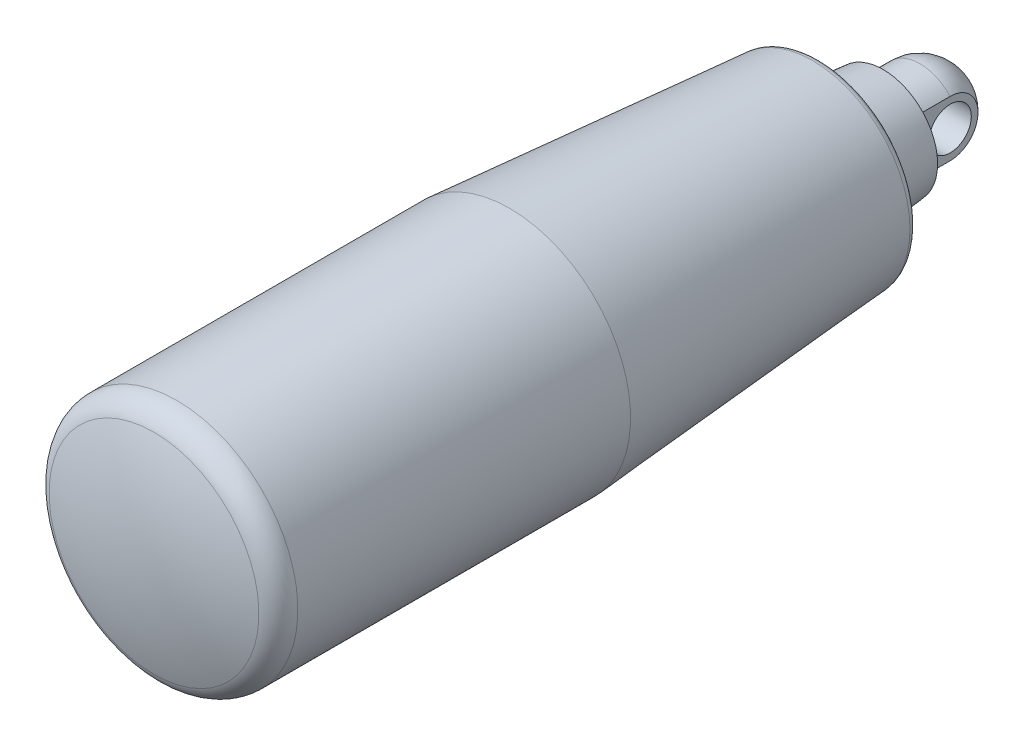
ISO-10303-21;
HEADER;
FILE_DESCRIPTION(('STEP AP214'),'2;1');
FILE_NAME('part.step','',(''),(''),'','','');
FILE_SCHEMA(('AUTOMOTIVE_DESIGN { 1 0 10303 214 1 1 1 1 }'));
ENDSEC;
DATA;
#1=APPLICATION_CONTEXT('core data for automotive mechanical design processes');
#2=APPLICATION_PROTOCOL_DEFINITION('international standard','automotive_design',2000,#1);
#3=PRODUCT_CONTEXT('',#1,'mechanical');
#4=PRODUCT('Part','Part','',(#3));
#5=PRODUCT_RELATED_PRODUCT_CATEGORY('part','',(#4));
#6=PRODUCT_DEFINITION_FORMATION('','',#4);
#7=PRODUCT_DEFINITION_CONTEXT('part definition',#1,'design');
#8=PRODUCT_DEFINITION('design','',#6,#7);
#9=PRODUCT_DEFINITION_SHAPE('','',#8);
#10=(LENGTH_UNIT() NAMED_UNIT(*) SI_UNIT(.MILLI.,.METRE.));
#11=(NAMED_UNIT(*) PLANE_ANGLE_UNIT() SI_UNIT($,.RADIAN.));
#12=(NAMED_UNIT(*) SI_UNIT($,.STERADIAN.) SOLID_ANGLE_UNIT());
#13=UNCERTAINTY_MEASURE_WITH_UNIT(LENGTH_MEASURE(1.E-05),#10,'distance_accuracy_value','');
#14=(GEOMETRIC_REPRESENTATION_CONTEXT(3) GLOBAL_UNCERTAINTY_ASSIGNED_CONTEXT((#13)) GLOBAL_UNIT_ASSIGNED_CONTEXT((#10,
#11,#12)) REPRESENTATION_CONTEXT('',''));
#15=CARTESIAN_POINT('',(0.,0.,0.));
#16=DIRECTION('',(0.,0.,1.));
#17=DIRECTION('',(1.,0.,0.));
#18=AXIS2_PLACEMENT_3D('',#15,#16,#17);
#19=CARTESIAN_POINT('',(20.,0.,0.));
#20=DIRECTION('',(1.,0.,0.));
#21=DIRECTION('',(0.,1.,0.));
#22=AXIS2_PLACEMENT_3D('',#19,#20,#21);
#23=CYLINDRICAL_SURFACE('',#22,2.);
#24=CARTESIAN_POINT('',(-2.875,0.,0.));
#25=DIRECTION('',(1.,0.,0.));
#26=DIRECTION('',(0.,1.,0.));
#27=AXIS2_PLACEMENT_3D('',#24,#25,#26);
#28=CIRCLE('',#27,2.);
#29=CARTESIAN_POINT('',(-2.875,2.,0.));
#30=VERTEX_POINT('',#29);
#31=EDGE_CURVE('E86',#30,#30,#28,.F.);
#32=ORIENTED_EDGE('',*,*,#31,.T.);
#33=EDGE_LOOP('',(#32));
#34=FACE_BOUND('',#33,.T.);
#35=CARTESIAN_POINT('',(2.875,0.,0.));
#36=DIRECTION('',(1.,0.,0.));
#37=DIRECTION('',(0.,1.,0.));
#38=AXIS2_PLACEMENT_3D('',#35,#36,#37);
#39=CIRCLE('',#38,2.);
#40=CARTESIAN_POINT('',(2.875,2.,0.));
#41=VERTEX_POINT('',#40);
#42=EDGE_CURVE('E19',#41,#41,#39,.F.);
#43=ORIENTED_EDGE('',*,*,#42,.F.);
#44=EDGE_LOOP('',(#43));
#45=FACE_BOUND('',#44,.T.);
#46=ADVANCED_FACE('F14',(#34,#45),#23,.F.);
#47=CARTESIAN_POINT('',(0.0100000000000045,0.,0.00999999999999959));
#48=DIRECTION('',(0.,-1.,0.));
#49=DIRECTION('',(1.,0.,0.));
#50=AXIS2_PLACEMENT_3D('',#47,#48,#49);
#51=CIRCLE('',#50,3.9);
#52=TRIMMED_CURVE('',#51,(PARAMETER_VALUE(-1.57336043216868)),
(PARAMETER_VALUE(1.57336043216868)),.T.,.PARAMETER.);
#53=CARTESIAN_POINT('',(0.,0.,0.00999999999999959));
#54=DIRECTION('',(0.,0.,1.));
#55=AXIS1_PLACEMENT('',#53,#54);
#56=SURFACE_OF_REVOLUTION('',#52,#55);
#57=CARTESIAN_POINT('',(0.,0.,-3.88998717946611));
#58=VERTEX_POINT('',#57);
#59=VERTEX_LOOP('',#58);
#60=FACE_BOUND('',#59,.T.);
#61=CARTESIAN_POINT('',(0.,0.,0.00999999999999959));
#62=DIRECTION('',(0.,0.,-1.));
#63=DIRECTION('',(0.,1.,0.));
#64=AXIS2_PLACEMENT_3D('',#61,#62,#63);
#65=CIRCLE('',#64,3.91);
#66=CARTESIAN_POINT('',(2.875,2.64999528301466,0.00999999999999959));
#67=VERTEX_POINT('',#66);
#68=CARTESIAN_POINT('',(-2.875,2.64999528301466,0.00999999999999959));
#69=VERTEX_POINT('',#68);
#70=EDGE_CURVE('E64',#67,#69,#65,.F.);
#71=ORIENTED_EDGE('',*,*,#70,.F.);
#72=CARTESIAN_POINT('',(2.875,-2.64999528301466,0.00999999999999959));
#73=CARTESIAN_POINT('',(2.875,-2.64999481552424,-0.064401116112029));
#74=CARTESIAN_POINT('',(2.875,-2.64685195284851,-0.138766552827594));
#75=CARTESIAN_POINT('',(2.875,-2.63431399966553,-0.28696469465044));
#76=CARTESIAN_POINT('',(2.875,-2.62491921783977,-0.360797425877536));
#77=CARTESIAN_POINT('',(2.875,-2.58744588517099,-0.580577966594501));
#78=CARTESIAN_POINT('',(2.875,-2.55007810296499,-0.72505216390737));
#79=CARTESIAN_POINT('',(2.875,-2.45161413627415,-1.00566603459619));
#80=CARTESIAN_POINT('',(2.875,-2.39050709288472,-1.14180186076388));
#81=CARTESIAN_POINT('',(2.875,-2.24631487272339,-1.40187676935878));
#82=CARTESIAN_POINT('',(2.875,-2.16323393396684,-1.52581819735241));
#83=CARTESIAN_POINT('',(2.875,-1.97744716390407,-1.75801135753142));
#84=CARTESIAN_POINT('',(2.875,-1.87473928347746,-1.86626144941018));
#85=CARTESIAN_POINT('',(2.875,-1.65260918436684,-2.06402226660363));
#86=CARTESIAN_POINT('',(2.875,-1.53318437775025,-2.15353008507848));
#87=CARTESIAN_POINT('',(2.875,-1.28089234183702,-2.31134889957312));
#88=CARTESIAN_POINT('',(2.875,-1.14801115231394,-2.37963757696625));
#89=CARTESIAN_POINT('',(2.875,-0.872691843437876,-2.49297406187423));
#90=CARTESIAN_POINT('',(2.875,-0.730254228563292,-2.53802309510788));
#91=CARTESIAN_POINT('',(2.875,-0.439606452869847,-2.60368573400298));
#92=CARTESIAN_POINT('',(2.875,-0.291387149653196,-2.62425887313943));
#93=CARTESIAN_POINT('',(2.875,0.00640670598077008,-2.64026272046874));
#94=CARTESIAN_POINT('',(2.875,0.155981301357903,-2.63569262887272));
#95=CARTESIAN_POINT('',(2.875,0.452420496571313,-2.60151491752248));
#96=CARTESIAN_POINT('',(2.875,0.599281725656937,-2.57187804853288));
#97=CARTESIAN_POINT('',(2.875,0.885938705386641,-2.48835511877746));
#98=CARTESIAN_POINT('',(2.875,1.02573450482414,-2.43446922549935));
#99=CARTESIAN_POINT('',(2.875,1.29420364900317,-2.30399710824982));
#100=CARTESIAN_POINT('',(2.875,1.42288307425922,-2.22742339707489));
#101=CARTESIAN_POINT('',(2.875,1.66552525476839,-2.05372889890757));
#102=CARTESIAN_POINT('',(2.875,1.77948884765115,-1.95660928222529));
#103=CARTESIAN_POINT('',(2.875,1.9892601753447,-1.74476571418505));
#104=CARTESIAN_POINT('',(2.875,2.08509966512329,-1.63007320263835));
#105=CARTESIAN_POINT('',(2.875,2.25616291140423,-1.38616312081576));
#106=CARTESIAN_POINT('',(2.875,2.33138023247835,-1.25694103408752));
#107=CARTESIAN_POINT('',(2.875,2.458958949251,-0.987812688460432));
#108=CARTESIAN_POINT('',(2.875,2.5113370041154,-0.847914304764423));
#109=CARTESIAN_POINT('',(2.875,2.59176333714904,-0.561415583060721));
#110=CARTESIAN_POINT('',(2.875,2.6198489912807,-0.414825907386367));
#111=CARTESIAN_POINT('',(2.875,2.6402872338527,-0.221052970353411));
#112=CARTESIAN_POINT('',(2.875,2.64392966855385,-0.174876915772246));
#113=CARTESIAN_POINT('',(2.875,2.64878036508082,-0.0824734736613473));
#114=CARTESIAN_POINT('',(2.875,2.64999263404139,-0.0362462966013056));
#115=CARTESIAN_POINT('',(2.875,2.64999528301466,0.00999999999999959));
#116=B_SPLINE_CURVE_WITH_KNOTS('',3,(#72,#73,#74,#75,#76,#77,#78,#79,#80,#81,#82,#83,#84,#85,
#86,#87,#88,#89,#90,#91,#92,#93,#94,#95,#96,#97,#98,#99,#100,#101,#102,#103,#104,#105,#106,#107,
#108,#109,#110,#111,#112,#113,#114,#115),.UNSPECIFIED.,.F.,.F.,(4,2,2,2,2,2,2,2,2,2,2,2,2,2,2,2,
2,2,2,2,2,4),(0.,0.22306612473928,0.446121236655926,0.891508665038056,1.33710006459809,
1.78260558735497,2.22815764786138,2.67377876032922,3.11986700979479,3.56593172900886,
4.01273291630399,4.45954831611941,4.90688580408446,5.35422020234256,5.80130834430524,
6.2483710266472,6.6946430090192,7.14105409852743,7.58713902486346,8.03253638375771,
8.17145040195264,8.31013517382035),.UNSPECIFIED.);
#117=CARTESIAN_POINT('',(2.875,-2.64999528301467,0.00999999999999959));
#118=VERTEX_POINT('',#117);
#119=EDGE_CURVE('E57',#118,#67,#116,.T.);
#120=ORIENTED_EDGE('',*,*,#119,.F.);
#121=CARTESIAN_POINT('',(0.,0.,0.00999999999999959));
#122=DIRECTION('',(0.,0.,-1.));
#123=DIRECTION('',(0.,1.,0.));
#124=AXIS2_PLACEMENT_3D('',#121,#122,#123);
#125=CIRCLE('',#124,3.91);
#126=CARTESIAN_POINT('',(-2.875,-2.64999528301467,0.00999999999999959));
#127=VERTEX_POINT('',#126);
#128=EDGE_CURVE('E89',#127,#118,#125,.F.);
#129=ORIENTED_EDGE('',*,*,#128,.F.);
#130=CARTESIAN_POINT('',(-2.875,-2.64999528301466,0.00999999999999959));
#131=CARTESIAN_POINT('',(-2.875,-2.64999481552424,-0.064401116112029));
#132=CARTESIAN_POINT('',(-2.875,-2.64685195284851,-0.138766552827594));
#133=CARTESIAN_POINT('',(-2.875,-2.63431399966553,-0.28696469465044));
#134=CARTESIAN_POINT('',(-2.875,-2.62491921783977,-0.360797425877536));
#135=CARTESIAN_POINT('',(-2.875,-2.58744588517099,-0.580577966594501));
#136=CARTESIAN_POINT('',(-2.875,-2.55007810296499,-0.72505216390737));
#137=CARTESIAN_POINT('',(-2.875,-2.45161413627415,-1.00566603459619));
#138=CARTESIAN_POINT('',(-2.875,-2.39050709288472,-1.14180186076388));
#139=CARTESIAN_POINT('',(-2.875,-2.24631487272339,-1.40187676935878));
#140=CARTESIAN_POINT('',(-2.875,-2.16323393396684,-1.52581819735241));
#141=CARTESIAN_POINT('',(-2.875,-1.97744716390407,-1.75801135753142));
#142=CARTESIAN_POINT('',(-2.875,-1.87473928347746,-1.86626144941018));
#143=CARTESIAN_POINT('',(-2.875,-1.65260918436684,-2.06402226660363));
#144=CARTESIAN_POINT('',(-2.875,-1.53318437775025,-2.15353008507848));
#145=CARTESIAN_POINT('',(-2.875,-1.28089234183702,-2.31134889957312));
#146=CARTESIAN_POINT('',(-2.875,-1.14801115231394,-2.37963757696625));
#147=CARTESIAN_POINT('',(-2.875,-0.872691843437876,-2.49297406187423));
#148=CARTESIAN_POINT('',(-2.875,-0.730254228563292,-2.53802309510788));
#149=CARTESIAN_POINT('',(-2.875,-0.439606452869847,-2.60368573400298));
#150=CARTESIAN_POINT('',(-2.875,-0.291387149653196,-2.62425887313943));
#151=CARTESIAN_POINT('',(-2.875,0.00640670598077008,-2.64026272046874));
#152=CARTESIAN_POINT('',(-2.875,0.155981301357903,-2.63569262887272));
#153=CARTESIAN_POINT('',(-2.875,0.452420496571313,-2.60151491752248));
#154=CARTESIAN_POINT('',(-2.875,0.599281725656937,-2.57187804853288));
#155=CARTESIAN_POINT('',(-2.875,0.885938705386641,-2.48835511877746));
#156=CARTESIAN_POINT('',(-2.875,1.02573450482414,-2.43446922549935));
#157=CARTESIAN_POINT('',(-2.875,1.29420364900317,-2.30399710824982));
#158=CARTESIAN_POINT('',(-2.875,1.42288307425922,-2.22742339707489));
#159=CARTESIAN_POINT('',(-2.875,1.66552525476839,-2.05372889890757));
#160=CARTESIAN_POINT('',(-2.875,1.77948884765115,-1.95660928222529));
#161=CARTESIAN_POINT('',(-2.875,1.9892601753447,-1.74476571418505));
#162=CARTESIAN_POINT('',(-2.875,2.08509966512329,-1.63007320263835));
#163=CARTESIAN_POINT('',(-2.875,2.25616291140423,-1.38616312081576));
#164=CARTESIAN_POINT('',(-2.875,2.33138023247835,-1.25694103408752));
#165=CARTESIAN_POINT('',(-2.875,2.458958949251,-0.987812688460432));
#166=CARTESIAN_POINT('',(-2.875,2.5113370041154,-0.847914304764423));
#167=CARTESIAN_POINT('',(-2.875,2.59176333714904,-0.561415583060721));
#168=CARTESIAN_POINT('',(-2.875,2.6198489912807,-0.414825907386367));
#169=CARTESIAN_POINT('',(-2.875,2.6402872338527,-0.221052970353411));
#170=CARTESIAN_POINT('',(-2.875,2.64392966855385,-0.174876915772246));
#171=CARTESIAN_POINT('',(-2.875,2.64878036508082,-0.0824734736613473));
#172=CARTESIAN_POINT('',(-2.875,2.64999263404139,-0.0362462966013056));
#173=CARTESIAN_POINT('',(-2.875,2.64999528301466,0.00999999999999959));
#174=B_SPLINE_CURVE_WITH_KNOTS('',3,(#130,#131,#132,#133,#134,#135,#136,#137,#138,#139,#140,
#141,#142,#143,#144,#145,#146,#147,#148,#149,#150,#151,#152,#153,#154,#155,#156,#157,#158,#159,
#160,#161,#162,#163,#164,#165,#166,#167,#168,#169,#170,#171,#172,#173),.UNSPECIFIED.,.F.,.F.,(4,
2,2,2,2,2,2,2,2,2,2,2,2,2,2,2,2,2,2,2,2,4),(0.,0.22306612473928,0.446121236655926,
0.891508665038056,1.33710006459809,1.78260558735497,2.22815764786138,2.67377876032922,
3.11986700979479,3.56593172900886,4.01273291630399,4.45954831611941,4.90688580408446,
5.35422020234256,5.80130834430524,6.2483710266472,6.6946430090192,7.14105409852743,
7.58713902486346,8.03253638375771,8.17145040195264,8.31013517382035),.UNSPECIFIED.);
#175=EDGE_CURVE('E67',#127,#69,#174,.T.);
#176=ORIENTED_EDGE('',*,*,#175,.T.);
#177=EDGE_LOOP('',(#71,#120,#129,#176));
#178=FACE_BOUND('',#177,.T.);
#179=ADVANCED_FACE('F16',(#60,#178),#56,.T.);
#180=CARTESIAN_POINT('',(2.875,0.,-10.5));
#181=DIRECTION('',(1.,0.,0.));
#182=DIRECTION('',(0.,1.,0.));
#183=AXIS2_PLACEMENT_3D('',#180,#181,#182);
#184=PLANE('',#183);
#185=DIRECTION('',(0.,0.,-1.));
#186=VECTOR('',#185,1.);
#187=CARTESIAN_POINT('',(2.875,-2.64999528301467,-3.88998717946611));
#188=LINE('',#187,#186);
#189=CARTESIAN_POINT('',(2.875,-2.64999528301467,3.5));
#190=VERTEX_POINT('',#189);
#191=EDGE_CURVE('E87',#118,#190,#188,.F.);
#192=ORIENTED_EDGE('',*,*,#191,.F.);
#193=ORIENTED_EDGE('',*,*,#119,.T.);
#194=DIRECTION('',(0.,0.,-1.));
#195=VECTOR('',#194,1.);
#196=CARTESIAN_POINT('',(2.875,2.64999528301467,-3.88998717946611));
#197=LINE('',#196,#195);
#198=CARTESIAN_POINT('',(2.875,2.64999528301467,3.5));
#199=VERTEX_POINT('',#198);
#200=EDGE_CURVE('E70',#199,#67,#197,.T.);
#201=ORIENTED_EDGE('',*,*,#200,.F.);
#202=DIRECTION('',(0.,-1.,0.));
#203=VECTOR('',#202,1.);
#204=CARTESIAN_POINT('',(2.875,0.,3.5));
#205=LINE('',#204,#203);
#206=EDGE_CURVE('E69',#199,#190,#205,.T.);
#207=ORIENTED_EDGE('',*,*,#206,.T.);
#208=EDGE_LOOP('',(#192,#193,#201,#207));
#209=FACE_BOUND('',#208,.T.);
#210=ORIENTED_EDGE('',*,*,#42,.T.);
#211=EDGE_LOOP('',(#210));
#212=FACE_BOUND('',#211,.T.);
#213=ADVANCED_FACE('F62',(#209,#212),#184,.T.);
#214=CARTESIAN_POINT('',(0.,0.,-3.88998717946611));
#215=DIRECTION('',(0.,0.,-1.));
#216=DIRECTION('',(0.,1.,0.));
#217=AXIS2_PLACEMENT_3D('',#214,#215,#216);
#218=CYLINDRICAL_SURFACE('',#217,3.91);
#219=ORIENTED_EDGE('',*,*,#128,.T.);
#220=ORIENTED_EDGE('',*,*,#191,.T.);
#221=CARTESIAN_POINT('',(0.,0.,3.5));
#222=DIRECTION('',(0.,0.,-1.));
#223=DIRECTION('',(0.,1.,0.));
#224=AXIS2_PLACEMENT_3D('',#221,#222,#223);
#225=CIRCLE('',#224,3.91);
#226=CARTESIAN_POINT('',(-2.875,-2.64999528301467,3.5));
#227=VERTEX_POINT('',#226);
#228=EDGE_CURVE('E111',#190,#227,#225,.T.);
#229=ORIENTED_EDGE('',*,*,#228,.T.);
#230=DIRECTION('',(0.,0.,1.));
#231=VECTOR('',#230,1.);
#232=CARTESIAN_POINT('',(-2.875,-2.64999528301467,-10.5));
#233=LINE('',#232,#231);
#234=EDGE_CURVE('E83',#227,#127,#233,.F.);
#235=ORIENTED_EDGE('',*,*,#234,.T.);
#236=EDGE_LOOP('',(#219,#220,#229,#235));
#237=FACE_BOUND('',#236,.T.);
#238=ADVANCED_FACE('F124',(#237),#218,.T.);
#239=CARTESIAN_POINT('',(-2.875,0.,-10.5));
#240=DIRECTION('',(1.,0.,0.));
#241=DIRECTION('',(0.,1.,0.));
#242=AXIS2_PLACEMENT_3D('',#239,#240,#241);
#243=PLANE('',#242);
#244=DIRECTION('',(0.,0.,-1.));
#245=VECTOR('',#244,1.);
#246=CARTESIAN_POINT('',(-2.875,2.64999528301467,-3.88998717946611));
#247=LINE('',#246,#245);
#248=CARTESIAN_POINT('',(-2.875,2.64999528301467,3.5));
#249=VERTEX_POINT('',#248);
#250=EDGE_CURVE('E78',#69,#249,#247,.F.);
#251=ORIENTED_EDGE('',*,*,#250,.F.);
#252=ORIENTED_EDGE('',*,*,#175,.F.);
#253=ORIENTED_EDGE('',*,*,#234,.F.);
#254=DIRECTION('',(0.,-1.,0.));
#255=VECTOR('',#254,1.);
#256=CARTESIAN_POINT('',(-2.875,0.,3.5));
#257=LINE('',#256,#255);
#258=EDGE_CURVE('E34',#227,#249,#257,.F.);
#259=ORIENTED_EDGE('',*,*,#258,.T.);
#260=EDGE_LOOP('',(#251,#252,#253,#259));
#261=FACE_BOUND('',#260,.T.);
#262=ORIENTED_EDGE('',*,*,#31,.F.);
#263=EDGE_LOOP('',(#262));
#264=FACE_BOUND('',#263,.T.);
#265=ADVANCED_FACE('F119',(#261,#264),#243,.F.);
#266=CARTESIAN_POINT('',(0.,0.,-3.88998717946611));
#267=DIRECTION('',(0.,0.,-1.));
#268=DIRECTION('',(0.,1.,0.));
#269=AXIS2_PLACEMENT_3D('',#266,#267,#268);
#270=CYLINDRICAL_SURFACE('',#269,3.91);
#271=ORIENTED_EDGE('',*,*,#200,.T.);
#272=ORIENTED_EDGE('',*,*,#70,.T.);
#273=ORIENTED_EDGE('',*,*,#250,.T.);
#274=CARTESIAN_POINT('',(0.,0.,3.5));
#275=DIRECTION('',(0.,0.,-1.));
#276=DIRECTION('',(0.,1.,0.));
#277=AXIS2_PLACEMENT_3D('',#274,#275,#276);
#278=CIRCLE('',#277,3.91);
#279=EDGE_CURVE('E75',#249,#199,#278,.T.);
#280=ORIENTED_EDGE('',*,*,#279,.T.);
#281=EDGE_LOOP('',(#271,#272,#273,#280));
#282=FACE_BOUND('',#281,.T.);
#283=ADVANCED_FACE('F73',(#282),#270,.T.);
#284=CARTESIAN_POINT('',(0.,0.,3.5));
#285=DIRECTION('',(0.,0.,1.));
#286=DIRECTION('',(0.,-1.,0.));
#287=AXIS2_PLACEMENT_3D('',#284,#285,#286);
#288=PLANE('',#287);
#289=ORIENTED_EDGE('',*,*,#258,.F.);
#290=ORIENTED_EDGE('',*,*,#228,.F.);
#291=ORIENTED_EDGE('',*,*,#206,.F.);
#292=ORIENTED_EDGE('',*,*,#279,.F.);
#293=EDGE_LOOP('',(#289,#290,#291,#292));
#294=FACE_BOUND('',#293,.T.);
#295=CARTESIAN_POINT('',(0.,0.,3.50000000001));
#296=DIRECTION('',(0.,0.,1.));
#297=DIRECTION('',(1.,0.,0.));
#298=AXIS2_PLACEMENT_3D('',#295,#296,#297);
#299=CIRCLE('',#298,5.17192670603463);
#300=CARTESIAN_POINT('',(5.17192670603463,0.,3.50000000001));
#301=VERTEX_POINT('',#300);
#302=EDGE_CURVE('E107',#301,#301,#299,.T.);
#303=ORIENTED_EDGE('',*,*,#302,.F.);
#304=EDGE_LOOP('',(#303));
#305=FACE_BOUND('',#304,.T.);
#306=ADVANCED_FACE('F208',(#294,#305),#288,.F.);
#307=CARTESIAN_POINT('',(0.,0.,8.99999999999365));
#308=DIRECTION('',(0.,0.,1.));
#309=DIRECTION('',(1.,0.,0.));
#310=AXIS2_PLACEMENT_3D('',#307,#308,#309);
#311=CONICAL_SURFACE('',#310,5.74999999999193,0.104719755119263);
#312=ORIENTED_EDGE('',*,*,#302,.T.);
#313=EDGE_LOOP('',(#312));
#314=FACE_BOUND('',#313,.T.);
#315=CARTESIAN_POINT('',(0.,0.,8.99999999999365));
#316=DIRECTION('',(0.,0.,1.));
#317=DIRECTION('',(1.,0.,0.));
#318=AXIS2_PLACEMENT_3D('',#315,#316,#317);
#319=CIRCLE('',#318,5.74999999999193);
#320=CARTESIAN_POINT('',(5.74999999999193,0.,8.99999999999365));
#321=VERTEX_POINT('',#320);
#322=EDGE_CURVE('E104',#321,#321,#319,.F.);
#323=ORIENTED_EDGE('',*,*,#322,.T.);
#324=EDGE_LOOP('',(#323));
#325=FACE_BOUND('',#324,.T.);
#326=ADVANCED_FACE('F211',(#314,#325),#311,.T.);
#327=CARTESIAN_POINT('',(0.,-5.75,9.));
#328=DIRECTION('',(0.,0.,1.));
#329=DIRECTION('',(0.,-1.,0.));
#330=AXIS2_PLACEMENT_3D('',#327,#328,#329);
#331=PLANE('',#330);
#332=ORIENTED_EDGE('',*,*,#322,.F.);
#333=EDGE_LOOP('',(#332));
#334=FACE_BOUND('',#333,.T.);
#335=CARTESIAN_POINT('',(0.,0.,9.));
#336=DIRECTION('',(0.,0.,-1.));
#337=DIRECTION('',(0.,1.,0.));
#338=AXIS2_PLACEMENT_3D('',#335,#336,#337);
#339=CIRCLE('',#338,8.05);
#340=CARTESIAN_POINT('',(0.,8.05,9.));
#341=VERTEX_POINT('',#340);
#342=EDGE_CURVE('E101',#341,#341,#339,.F.);
#343=ORIENTED_EDGE('',*,*,#342,.F.);
#344=EDGE_LOOP('',(#343));
#345=FACE_BOUND('',#344,.T.);
#346=ADVANCED_FACE('F216',(#334,#345),#331,.F.);
#347=CARTESIAN_POINT('',(0.,0.,74.5));
#348=DIRECTION('',(0.,0.,-1.));
#349=DIRECTION('',(0.,1.,0.));
#350=AXIS2_PLACEMENT_3D('',#347,#348,#349);
#351=CYLINDRICAL_SURFACE('',#350,8.05);
#352=ORIENTED_EDGE('',*,*,#342,.T.);
#353=EDGE_LOOP('',(#352));
#354=FACE_BOUND('',#353,.T.);
#355=CARTESIAN_POINT('',(0.,0.,9.5));
#356=DIRECTION('',(0.,0.,-1.));
#357=DIRECTION('',(0.,1.,0.));
#358=AXIS2_PLACEMENT_3D('',#355,#356,#357);
#359=CIRCLE('',#358,8.05);
#360=CARTESIAN_POINT('',(0.,8.05,9.5));
#361=VERTEX_POINT('',#360);
#362=EDGE_CURVE('E98',#361,#361,#359,.T.);
#363=ORIENTED_EDGE('',*,*,#362,.T.);
#364=EDGE_LOOP('',(#363));
#365=FACE_BOUND('',#364,.T.);
#366=ADVANCED_FACE('F184',(#354,#365),#351,.T.);
#367=CARTESIAN_POINT('',(0.,-8.05,9.5));
#368=DIRECTION('',(0.,0.,1.));
#369=DIRECTION('',(0.,-1.,0.));
#370=AXIS2_PLACEMENT_3D('',#367,#368,#369);
#371=PLANE('',#370);
#372=ORIENTED_EDGE('',*,*,#362,.F.);
#373=EDGE_LOOP('',(#372));
#374=FACE_BOUND('',#373,.T.);
#375=CARTESIAN_POINT('',(0.,0.,9.50000000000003));
#376=DIRECTION('',(0.,0.,1.));
#377=DIRECTION('',(0.,-1.,0.));
#378=AXIS2_PLACEMENT_3D('',#375,#376,#377);
#379=CIRCLE('',#378,8.49078070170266);
#380=CARTESIAN_POINT('',(0.,-8.49078070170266,9.50000000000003));
#381=VERTEX_POINT('',#380);
#382=EDGE_CURVE('E97',#381,#381,#379,.T.);
#383=ORIENTED_EDGE('',*,*,#382,.F.);
#384=EDGE_LOOP('',(#383));
#385=FACE_BOUND('',#384,.T.);
#386=ADVANCED_FACE('F179',(#374,#385),#371,.F.);
#387=CARTESIAN_POINT('',(0.,0.,44.6));
#388=DIRECTION('',(0.,-1.,0.));
#389=DIRECTION('',(1.,0.,0.));
#390=AXIS2_PLACEMENT_3D('',#387,#388,#389);
#391=SPHERICAL_SURFACE('',#390,29.9);
#392=CARTESIAN_POINT('',(0.,0.,72.78999027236));
#393=DIRECTION('',(0.,0.,1.));
#394=DIRECTION('',(0.,-1.,0.));
#395=AXIS2_PLACEMENT_3D('',#392,#393,#394);
#396=CIRCLE('',#395,9.9666668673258);
#397=CARTESIAN_POINT('',(0.,-9.9666668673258,72.78999027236));
#398=VERTEX_POINT('',#397);
#399=EDGE_CURVE('E93',#398,#398,#396,.F.);
#400=ORIENTED_EDGE('',*,*,#399,.F.);
#401=EDGE_LOOP('',(#400));
#402=FACE_BOUND('',#401,.T.);
#403=ADVANCED_FACE('F176',(#402),#391,.T.);
#404=CARTESIAN_POINT('',(0.,0.,10.2666666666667));
#405=DIRECTION('',(0.,0.,1.));
#406=DIRECTION('',(0.,-1.,0.));
#407=AXIS2_PLACEMENT_3D('',#404,#405,#406);
#408=TOROIDAL_SURFACE('',#407,8.49078070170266,0.766666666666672);
#409=CARTESIAN_POINT('',(0.,0.,10.2070735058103));
#410=DIRECTION('',(0.,0.,1.));
#411=DIRECTION('',(0.,-1.,0.));
#412=AXIS2_PLACEMENT_3D('',#409,#410,#411);
#413=CIRCLE('',#412,9.2551277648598);
#414=CARTESIAN_POINT('',(0.,-9.2551277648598,10.2070735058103));
#415=VERTEX_POINT('',#414);
#416=EDGE_CURVE('E96',#415,#415,#413,.T.);
#417=ORIENTED_EDGE('',*,*,#416,.F.);
#418=EDGE_LOOP('',(#417));
#419=FACE_BOUND('',#418,.T.);
#420=ORIENTED_EDGE('',*,*,#382,.T.);
#421=EDGE_LOOP('',(#420));
#422=FACE_BOUND('',#421,.T.);
#423=ADVANCED_FACE('F161',(#419,#422),#408,.T.);
#424=CARTESIAN_POINT('',(0.,0.,70.621529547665));
#425=DIRECTION('',(0.,0.,1.));
#426=DIRECTION('',(0.,-1.,0.));
#427=AXIS2_PLACEMENT_3D('',#424,#425,#426);
#428=TOROIDAL_SURFACE('',#427,9.2,2.3);
#429=ORIENTED_EDGE('',*,*,#399,.T.);
#430=EDGE_LOOP('',(#429));
#431=FACE_BOUND('',#430,.T.);
#432=CARTESIAN_POINT('',(0.,0.,70.621529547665));
#433=DIRECTION('',(0.,0.,-1.));
#434=DIRECTION('',(0.,1.,0.));
#435=AXIS2_PLACEMENT_3D('',#432,#433,#434);
#436=CIRCLE('',#435,11.5);
#437=CARTESIAN_POINT('',(0.,11.5,70.621529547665));
#438=VERTEX_POINT('',#437);
#439=EDGE_CURVE('E25',#438,#438,#436,.T.);
#440=ORIENTED_EDGE('',*,*,#439,.F.);
#441=EDGE_LOOP('',(#440));
#442=FACE_BOUND('',#441,.T.);
#443=ADVANCED_FACE('F153',(#431,#442),#428,.T.);
#444=CARTESIAN_POINT('',(0.,0.,39.));
#445=DIRECTION('',(0.,0.,1.));
#446=DIRECTION('',(1.,0.,0.));
#447=AXIS2_PLACEMENT_3D('',#444,#445,#446);
#448=CONICAL_SURFACE('',#447,11.5,0.0778086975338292);
#449=ORIENTED_EDGE('',*,*,#416,.T.);
#450=EDGE_LOOP('',(#449));
#451=FACE_BOUND('',#450,.T.);
#452=CARTESIAN_POINT('',(0.,0.,39.));
#453=DIRECTION('',(0.,0.,-1.));
#454=DIRECTION('',(0.,1.,0.));
#455=AXIS2_PLACEMENT_3D('',#452,#453,#454);
#456=CIRCLE('',#455,11.5);
#457=CARTESIAN_POINT('',(0.,11.5,39.));
#458=VERTEX_POINT('',#457);
#459=EDGE_CURVE('E9',#458,#458,#456,.F.);
#460=ORIENTED_EDGE('',*,*,#459,.F.);
#461=EDGE_LOOP('',(#460));
#462=FACE_BOUND('',#461,.T.);
#463=ADVANCED_FACE('F147',(#451,#462),#448,.T.);
#464=CARTESIAN_POINT('',(0.,0.,74.5));
#465=DIRECTION('',(0.,0.,-1.));
#466=DIRECTION('',(0.,1.,0.));
#467=AXIS2_PLACEMENT_3D('',#464,#465,#466);
#468=CYLINDRICAL_SURFACE('',#467,11.5);
#469=ORIENTED_EDGE('',*,*,#459,.T.);
#470=EDGE_LOOP('',(#469));
#471=FACE_BOUND('',#470,.T.);
#472=ORIENTED_EDGE('',*,*,#439,.T.);
#473=EDGE_LOOP('',(#472));
#474=FACE_BOUND('',#473,.T.);
#475=ADVANCED_FACE('F145',(#471,#474),#468,.T.);
#476=CLOSED_SHELL('',(#46,#179,#213,#238,#265,#283,#306,#326,#346,#366,#386,#403,#423,#443,#463,#475));
#477=MANIFOLD_SOLID_BREP('B1',#476);
#478=ADVANCED_BREP_SHAPE_REPRESENTATION('',(#18,#477),#14);
#479=SHAPE_DEFINITION_REPRESENTATION(#9,#478);
ENDSEC;
END-ISO-10303-21;
